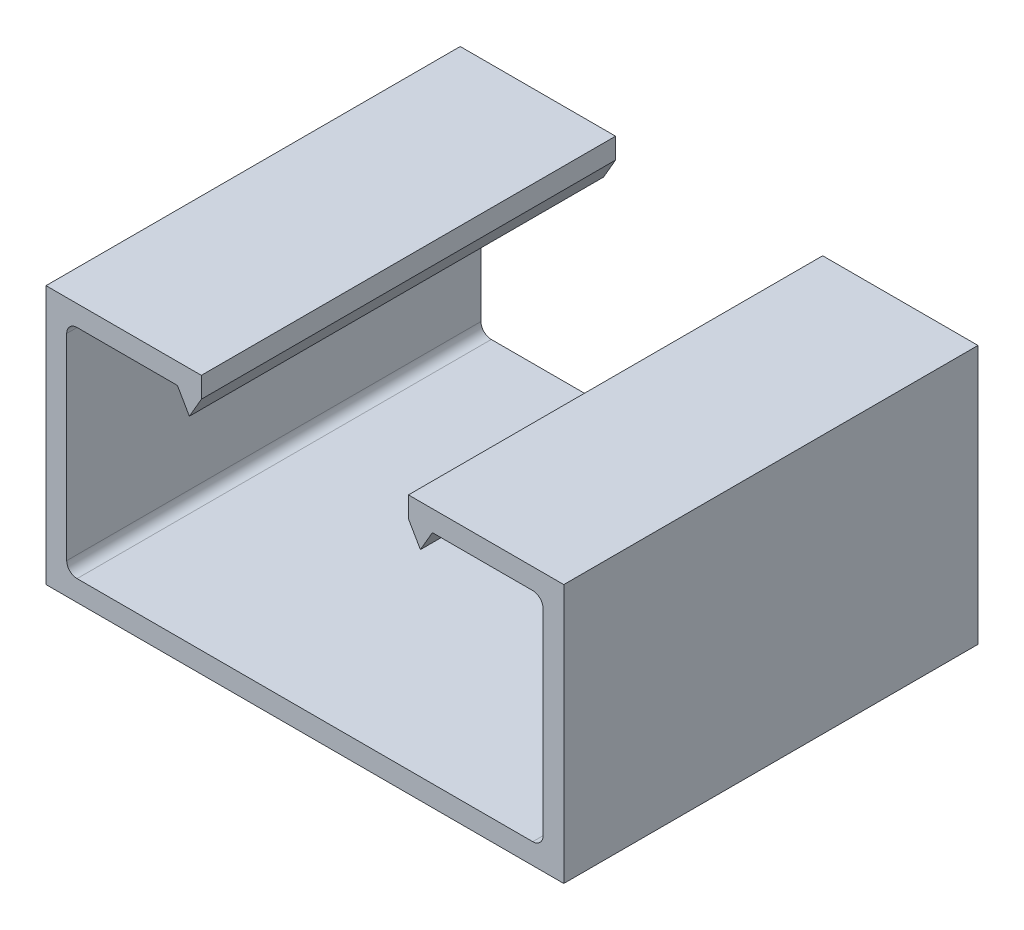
from build123d import *

# Parameters (mm, degrees)
BASE_EXTRUDE_DEPTH = 12.7


with BuildPart() as part:
    # Sketch1 → Base-Extrude (new, symmetric)
    with BuildSketch(Plane.XY):
        with BuildLine():
            Line((-6.35, 7.9375), (-15.875, 7.9375))
            Line((-15.875, 7.9375), (-15.875, -7.9375))
            Line((-15.875, -7.9375), (15.875, -7.9375))
            Line((15.875, -7.9375), (15.875, 7.9375))
            Line((15.875, 7.9375), (6.35, 7.9375))
            Line((6.35, 7.9375), (6.35, 6.6675))
            Line((6.35, 6.6675), (7.083234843, 5.3975))
            Line((7.083234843, 5.3975), (7.816469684, 6.6675))
            Line((7.816469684, 6.6675), (13.97, 6.6675))
            ThreePointArc((13.97, 6.6675), (14.419012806, 6.481512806), (14.605, 6.0325))
            Line((14.605, 6.0325), (14.605, -6.0325))
            ThreePointArc((14.605, -6.0325), (14.419012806, -6.481512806), (13.97, -6.6675))
            Line((13.97, -6.6675), (-13.97, -6.6675))
            ThreePointArc((-13.97, -6.6675), (-14.419012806, -6.481512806), (-14.605, -6.0325))
            Line((-14.605, -6.0325), (-14.605, 6.0325))
            ThreePointArc((-14.605, 6.0325), (-14.419012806, 6.481512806), (-13.97, 6.6675))
            Line((-13.97, 6.6675), (-7.816469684, 6.6675))
            Line((-7.816469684, 6.6675), (-7.083234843, 5.3975))
            Line((-7.083234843, 5.3975), (-6.35, 6.6675))
            Line((-6.35, 6.6675), (-6.35, 7.9375))
        make_face()
    extrude(amount=BASE_EXTRUDE_DEPTH, both=True)


solid = part.part
